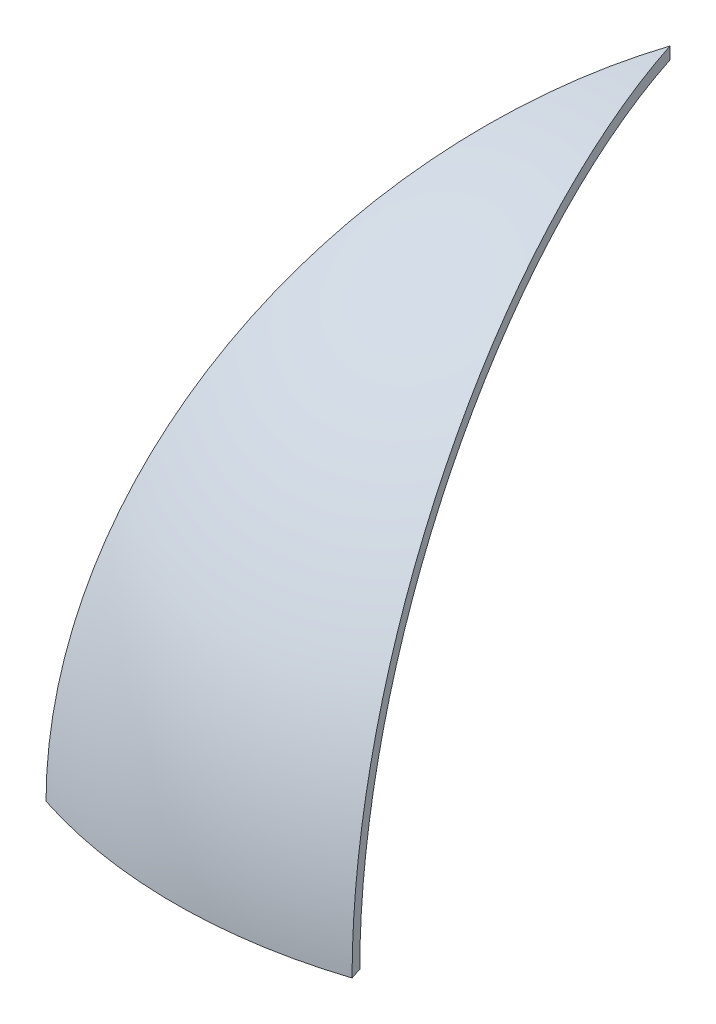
ISO-10303-21;
HEADER;
FILE_DESCRIPTION(('STEP AP214'),'2;1');
FILE_NAME('part.step','',(''),(''),'','','');
FILE_SCHEMA(('AUTOMOTIVE_DESIGN { 1 0 10303 214 1 1 1 1 }'));
ENDSEC;
DATA;
#1=APPLICATION_CONTEXT('core data for automotive mechanical design processes');
#2=APPLICATION_PROTOCOL_DEFINITION('international standard','automotive_design',2000,#1);
#3=PRODUCT_CONTEXT('',#1,'mechanical');
#4=PRODUCT('Part','Part','',(#3));
#5=PRODUCT_RELATED_PRODUCT_CATEGORY('part','',(#4));
#6=PRODUCT_DEFINITION_FORMATION('','',#4);
#7=PRODUCT_DEFINITION_CONTEXT('part definition',#1,'design');
#8=PRODUCT_DEFINITION('design','',#6,#7);
#9=PRODUCT_DEFINITION_SHAPE('','',#8);
#10=(LENGTH_UNIT() NAMED_UNIT(*) SI_UNIT(.MILLI.,.METRE.));
#11=(NAMED_UNIT(*) PLANE_ANGLE_UNIT() SI_UNIT($,.RADIAN.));
#12=(NAMED_UNIT(*) SI_UNIT($,.STERADIAN.) SOLID_ANGLE_UNIT());
#13=UNCERTAINTY_MEASURE_WITH_UNIT(LENGTH_MEASURE(1.E-05),#10,'distance_accuracy_value','');
#14=(GEOMETRIC_REPRESENTATION_CONTEXT(3) GLOBAL_UNCERTAINTY_ASSIGNED_CONTEXT((#13)) GLOBAL_UNIT_ASSIGNED_CONTEXT((#10,
#11,#12)) REPRESENTATION_CONTEXT('',''));
#15=CARTESIAN_POINT('',(0.,0.,0.));
#16=DIRECTION('',(0.,0.,1.));
#17=DIRECTION('',(1.,0.,0.));
#18=AXIS2_PLACEMENT_3D('',#15,#16,#17);
#19=CARTESIAN_POINT('',(0.,0.,0.));
#20=DIRECTION('',(0.,-1.,0.));
#21=DIRECTION('',(0.,0.,-1.));
#22=AXIS2_PLACEMENT_3D('',#19,#20,#21);
#23=PLANE('',#22);
#24=DIRECTION('',(-0.309016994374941,0.,-0.951056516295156));
#25=VECTOR('',#24,1.);
#26=CARTESIAN_POINT('',(0.,0.,0.));
#27=LINE('',#26,#25);
#28=CARTESIAN_POINT('',(316.742419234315,0.,974.832929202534));
#29=VERTEX_POINT('',#28);
#30=CARTESIAN_POINT('',(309.016994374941,0.,951.056516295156));
#31=VERTEX_POINT('',#30);
#32=EDGE_CURVE('E65',#29,#31,#27,.T.);
#33=ORIENTED_EDGE('',*,*,#32,.F.);
#34=CARTESIAN_POINT('',(0.,0.,0.));
#35=DIRECTION('',(0.,-1.,0.));
#36=DIRECTION('',(0.,0.,-1.));
#37=AXIS2_PLACEMENT_3D('',#34,#35,#36);
#38=CIRCLE('',#37,1025.);
#39=CARTESIAN_POINT('',(-316.742419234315,0.,974.832929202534));
#40=VERTEX_POINT('',#39);
#41=EDGE_CURVE('E74',#29,#40,#38,.T.);
#42=ORIENTED_EDGE('',*,*,#41,.T.);
#43=DIRECTION('',(-0.309016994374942,0.,0.951056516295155));
#44=VECTOR('',#43,1.);
#45=CARTESIAN_POINT('',(0.,0.,0.));
#46=LINE('',#45,#44);
#47=CARTESIAN_POINT('',(-309.016994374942,0.,951.056516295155));
#48=VERTEX_POINT('',#47);
#49=EDGE_CURVE('E76',#48,#40,#46,.T.);
#50=ORIENTED_EDGE('',*,*,#49,.F.);
#51=CARTESIAN_POINT('',(0.,0.,0.));
#52=DIRECTION('',(0.,-1.,0.));
#53=DIRECTION('',(0.,0.,-1.));
#54=AXIS2_PLACEMENT_3D('',#51,#52,#53);
#55=CIRCLE('',#54,1000.);
#56=EDGE_CURVE('E68',#31,#48,#55,.T.);
#57=ORIENTED_EDGE('',*,*,#56,.F.);
#58=EDGE_LOOP('',(#33,#42,#50,#57));
#59=FACE_BOUND('',#58,.T.);
#60=ADVANCED_FACE('F31',(#59),#23,.T.);
#61=CARTESIAN_POINT('',(0.,0.,0.));
#62=DIRECTION('',(0.,-1.,0.));
#63=DIRECTION('',(0.,0.,-1.));
#64=AXIS2_PLACEMENT_3D('',#61,#62,#63);
#65=SPHERICAL_SURFACE('',#64,1025.);
#66=CARTESIAN_POINT('',(0.,0.,0.));
#67=DIRECTION('',(-0.951056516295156,0.,0.309016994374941));
#68=DIRECTION('',(0.309016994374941,0.,0.951056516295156));
#69=AXIS2_PLACEMENT_3D('',#66,#67,#68);
#70=CIRCLE('',#69,1025.);
#71=CARTESIAN_POINT('',(0.,1025.,0.));
#72=VERTEX_POINT('',#71);
#73=EDGE_CURVE('E62',#72,#29,#70,.F.);
#74=ORIENTED_EDGE('',*,*,#73,.F.);
#75=CARTESIAN_POINT('',(0.,0.,0.));
#76=DIRECTION('',(0.951056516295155,0.,0.309016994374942));
#77=DIRECTION('',(0.309016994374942,0.,-0.951056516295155));
#78=AXIS2_PLACEMENT_3D('',#75,#76,#77);
#79=CIRCLE('',#78,1025.);
#80=EDGE_CURVE('E50',#40,#72,#79,.F.);
#81=ORIENTED_EDGE('',*,*,#80,.F.);
#82=ORIENTED_EDGE('',*,*,#41,.F.);
#83=EDGE_LOOP('',(#74,#81,#82));
#84=FACE_BOUND('',#83,.T.);
#85=ADVANCED_FACE('F78',(#84),#65,.T.);
#86=CARTESIAN_POINT('',(0.,0.,0.));
#87=DIRECTION('',(0.,-1.,0.));
#88=DIRECTION('',(0.,0.,-1.));
#89=AXIS2_PLACEMENT_3D('',#86,#87,#88);
#90=SPHERICAL_SURFACE('',#89,1000.);
#91=CARTESIAN_POINT('',(0.,0.,0.));
#92=DIRECTION('',(0.951056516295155,0.,0.309016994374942));
#93=DIRECTION('',(0.309016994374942,0.,-0.951056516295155));
#94=AXIS2_PLACEMENT_3D('',#91,#92,#93);
#95=CIRCLE('',#94,1000.);
#96=CARTESIAN_POINT('',(0.,1000.,0.));
#97=VERTEX_POINT('',#96);
#98=EDGE_CURVE('E38',#48,#97,#95,.F.);
#99=ORIENTED_EDGE('',*,*,#98,.T.);
#100=CARTESIAN_POINT('',(0.,0.,0.));
#101=DIRECTION('',(-0.951056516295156,0.,0.309016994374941));
#102=DIRECTION('',(0.309016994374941,0.,0.951056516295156));
#103=AXIS2_PLACEMENT_3D('',#100,#101,#102);
#104=CIRCLE('',#103,1000.);
#105=EDGE_CURVE('E11',#97,#31,#104,.F.);
#106=ORIENTED_EDGE('',*,*,#105,.T.);
#107=ORIENTED_EDGE('',*,*,#56,.T.);
#108=EDGE_LOOP('',(#99,#106,#107));
#109=FACE_BOUND('',#108,.T.);
#110=ADVANCED_FACE('F87',(#109),#90,.F.);
#111=CARTESIAN_POINT('',(0.,1500.,0.));
#112=DIRECTION('',(-0.951056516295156,0.,0.309016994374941));
#113=DIRECTION('',(0.309016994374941,0.,0.951056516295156));
#114=AXIS2_PLACEMENT_3D('',#111,#112,#113);
#115=PLANE('',#114);
#116=ORIENTED_EDGE('',*,*,#73,.T.);
#117=ORIENTED_EDGE('',*,*,#32,.T.);
#118=ORIENTED_EDGE('',*,*,#105,.F.);
#119=DIRECTION('',(0.,-1.,0.));
#120=VECTOR('',#119,1.);
#121=CARTESIAN_POINT('',(0.,1500.,0.));
#122=LINE('',#121,#120);
#123=EDGE_CURVE('E45',#72,#97,#122,.T.);
#124=ORIENTED_EDGE('',*,*,#123,.F.);
#125=EDGE_LOOP('',(#116,#117,#118,#124));
#126=FACE_BOUND('',#125,.T.);
#127=ADVANCED_FACE('F64',(#126),#115,.F.);
#128=CARTESIAN_POINT('',(0.,1500.,0.));
#129=DIRECTION('',(0.951056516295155,0.,0.309016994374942));
#130=DIRECTION('',(0.309016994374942,0.,-0.951056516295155));
#131=AXIS2_PLACEMENT_3D('',#128,#129,#130);
#132=PLANE('',#131);
#133=ORIENTED_EDGE('',*,*,#80,.T.);
#134=ORIENTED_EDGE('',*,*,#123,.T.);
#135=ORIENTED_EDGE('',*,*,#98,.F.);
#136=ORIENTED_EDGE('',*,*,#49,.T.);
#137=EDGE_LOOP('',(#133,#134,#135,#136));
#138=FACE_BOUND('',#137,.T.);
#139=ADVANCED_FACE('F85',(#138),#132,.F.);
#140=CLOSED_SHELL('',(#60,#85,#110,#127,#139));
#141=MANIFOLD_SOLID_BREP('B2',#140);
#142=ADVANCED_BREP_SHAPE_REPRESENTATION('',(#18,#141),#14);
#143=SHAPE_DEFINITION_REPRESENTATION(#9,#142);
ENDSEC;
END-ISO-10303-21;
